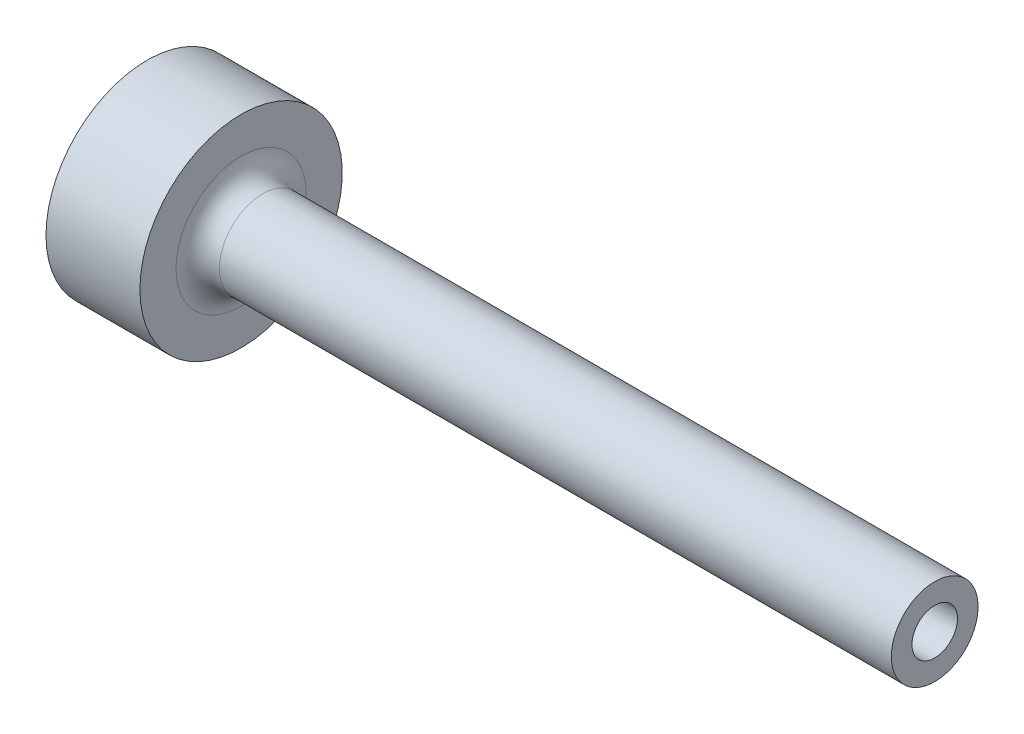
ISO-10303-21;
HEADER;
FILE_DESCRIPTION(('STEP AP214'),'2;1');
FILE_NAME('part.step','',(''),(''),'','','');
FILE_SCHEMA(('AUTOMOTIVE_DESIGN { 1 0 10303 214 1 1 1 1 }'));
ENDSEC;
DATA;
#1=APPLICATION_CONTEXT('core data for automotive mechanical design processes');
#2=APPLICATION_PROTOCOL_DEFINITION('international standard','automotive_design',2000,#1);
#3=PRODUCT_CONTEXT('',#1,'mechanical');
#4=PRODUCT('Part','Part','',(#3));
#5=PRODUCT_RELATED_PRODUCT_CATEGORY('part','',(#4));
#6=PRODUCT_DEFINITION_FORMATION('','',#4);
#7=PRODUCT_DEFINITION_CONTEXT('part definition',#1,'design');
#8=PRODUCT_DEFINITION('design','',#6,#7);
#9=PRODUCT_DEFINITION_SHAPE('','',#8);
#10=(LENGTH_UNIT() NAMED_UNIT(*) SI_UNIT(.MILLI.,.METRE.));
#11=(NAMED_UNIT(*) PLANE_ANGLE_UNIT() SI_UNIT($,.RADIAN.));
#12=(NAMED_UNIT(*) SI_UNIT($,.STERADIAN.) SOLID_ANGLE_UNIT());
#13=UNCERTAINTY_MEASURE_WITH_UNIT(LENGTH_MEASURE(1.E-05),#10,'distance_accuracy_value','');
#14=(GEOMETRIC_REPRESENTATION_CONTEXT(3) GLOBAL_UNCERTAINTY_ASSIGNED_CONTEXT((#13)) GLOBAL_UNIT_ASSIGNED_CONTEXT((#10,
#11,#12)) REPRESENTATION_CONTEXT('',''));
#15=CARTESIAN_POINT('',(0.,0.,0.));
#16=DIRECTION('',(0.,0.,1.));
#17=DIRECTION('',(1.,0.,0.));
#18=AXIS2_PLACEMENT_3D('',#15,#16,#17);
#19=CARTESIAN_POINT('',(0.,0.,0.));
#20=DIRECTION('',(-1.,0.,0.));
#21=DIRECTION('',(0.,0.,1.));
#22=AXIS2_PLACEMENT_3D('',#19,#20,#21);
#23=CYLINDRICAL_SURFACE('',#22,14.);
#24=CARTESIAN_POINT('',(13.,0.,0.));
#25=DIRECTION('',(-1.,0.,0.));
#26=DIRECTION('',(0.,0.,1.));
#27=AXIS2_PLACEMENT_3D('',#24,#25,#26);
#28=CIRCLE('',#27,14.);
#29=CARTESIAN_POINT('',(13.,0.,14.));
#30=VERTEX_POINT('',#29);
#31=EDGE_CURVE('E89',#30,#30,#28,.T.);
#32=ORIENTED_EDGE('',*,*,#31,.T.);
#33=EDGE_LOOP('',(#32));
#34=FACE_BOUND('',#33,.T.);
#35=CARTESIAN_POINT('',(0.,0.,0.));
#36=DIRECTION('',(-1.,0.,0.));
#37=DIRECTION('',(0.,0.,1.));
#38=AXIS2_PLACEMENT_3D('',#35,#36,#37);
#39=CIRCLE('',#38,14.);
#40=CARTESIAN_POINT('',(0.,0.,14.));
#41=VERTEX_POINT('',#40);
#42=EDGE_CURVE('E84',#41,#41,#39,.T.);
#43=ORIENTED_EDGE('',*,*,#42,.F.);
#44=EDGE_LOOP('',(#43));
#45=FACE_BOUND('',#44,.T.);
#46=CARTESIAN_POINT('',(6.5,-13.856406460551,-2.));
#47=CARTESIAN_POINT('',(6.61172417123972,-13.8564082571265,-1.99999534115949));
#48=CARTESIAN_POINT('',(6.72351471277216,-13.8577723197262,-1.99060664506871));
#49=CARTESIAN_POINT('',(6.9439746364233,-13.8630779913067,-1.95330740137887));
#50=CARTESIAN_POINT('',(7.05264079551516,-13.8670221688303,-1.92537839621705));
#51=CARTESIAN_POINT('',(7.26362870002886,-13.8770324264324,-1.85184738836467));
#52=CARTESIAN_POINT('',(7.36595507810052,-13.8830969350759,-1.80625847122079));
#53=CARTESIAN_POINT('',(7.56148972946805,-13.8966626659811,-1.69873175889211));
#54=CARTESIAN_POINT('',(7.65469934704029,-13.9041636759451,-1.63679637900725));
#55=CARTESIAN_POINT('',(7.83004829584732,-13.9198182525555,-1.49785346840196));
#56=CARTESIAN_POINT('',(7.91211171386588,-13.9279757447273,-1.42075056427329));
#57=CARTESIAN_POINT('',(8.06218155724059,-13.9439890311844,-1.25386707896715));
#58=CARTESIAN_POINT('',(8.13018723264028,-13.9518448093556,-1.16408582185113));
#59=CARTESIAN_POINT('',(8.25048909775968,-13.9664103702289,-0.973910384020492));
#60=CARTESIAN_POINT('',(8.30271571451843,-13.9731150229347,-0.873471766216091));
#61=CARTESIAN_POINT('',(8.38953073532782,-13.9845795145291,-0.665136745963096));
#62=CARTESIAN_POINT('',(8.4241199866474,-13.9893394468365,-0.557240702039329));
#63=CARTESIAN_POINT('',(8.47444920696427,-13.9963505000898,-0.337834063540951));
#64=CARTESIAN_POINT('',(8.49031606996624,-13.9986185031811,-0.226353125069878));
#65=CARTESIAN_POINT('',(8.5031438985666,-14.0004479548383,-0.00228956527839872));
#66=CARTESIAN_POINT('',(8.50010582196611,-14.0000095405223,0.110292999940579));
#67=CARTESIAN_POINT('',(8.47531062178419,-13.9964890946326,0.33249899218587));
#68=CARTESIAN_POINT('',(8.45369000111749,-13.9934263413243,0.442137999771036));
#69=CARTESIAN_POINT('',(8.39255744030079,-13.9850228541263,0.656215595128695));
#70=CARTESIAN_POINT('',(8.3530450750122,-13.9796820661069,0.760654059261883));
#71=CARTESIAN_POINT('',(8.25710925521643,-13.9672894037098,0.961781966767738));
#72=CARTESIAN_POINT('',(8.20062784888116,-13.9602316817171,1.05844339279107));
#73=CARTESIAN_POINT('',(8.07239950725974,-13.9451926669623,1.24096782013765));
#74=CARTESIAN_POINT('',(8.00065165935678,-13.9372113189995,1.32683017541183));
#75=CARTESIAN_POINT('',(7.843165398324,-13.921132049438,1.48612299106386));
#76=CARTESIAN_POINT('',(7.75730786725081,-13.9130337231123,1.55943569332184));
#77=CARTESIAN_POINT('',(7.57444547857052,-13.8977029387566,1.69062989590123));
#78=CARTESIAN_POINT('',(7.47744056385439,-13.890470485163,1.74851131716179));
#79=CARTESIAN_POINT('',(7.27491971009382,-13.8776905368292,1.84721301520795));
#80=CARTESIAN_POINT('',(7.1693981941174,-13.8721441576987,1.88802200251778));
#81=CARTESIAN_POINT('',(6.95290242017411,-13.8633846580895,1.9513062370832));
#82=CARTESIAN_POINT('',(6.84192850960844,-13.8601713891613,1.97378265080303));
#83=CARTESIAN_POINT('',(6.61872346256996,-13.8564698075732,1.99960390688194));
#84=CARTESIAN_POINT('',(6.50651197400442,-13.8559577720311,2.00311531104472));
#85=CARTESIAN_POINT('',(6.28310219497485,-13.8576537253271,1.9913480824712));
#86=CARTESIAN_POINT('',(6.17190387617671,-13.8598616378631,1.9760699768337));
#87=CARTESIAN_POINT('',(5.95418781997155,-13.8667269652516,1.92729837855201));
#88=CARTESIAN_POINT('',(5.84765127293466,-13.8713733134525,1.8938871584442));
#89=CARTESIAN_POINT('',(5.6416912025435,-13.8825829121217,1.80988306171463));
#90=CARTESIAN_POINT('',(5.54226800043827,-13.8891462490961,1.75928940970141));
#91=CARTESIAN_POINT('',(5.35260812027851,-13.9035064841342,1.64195360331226));
#92=CARTESIAN_POINT('',(5.26243903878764,-13.911311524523,1.57510320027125));
#93=CARTESIAN_POINT('',(5.09454027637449,-13.9272509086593,1.42730277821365));
#94=CARTESIAN_POINT('',(5.01681123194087,-13.9353852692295,1.34635203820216));
#95=CARTESIAN_POINT('',(4.8754047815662,-13.9511405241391,1.17191708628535));
#96=CARTESIAN_POINT('',(4.81183747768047,-13.9587570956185,1.07834317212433));
#97=CARTESIAN_POINT('',(4.70132443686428,-13.972552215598,0.881748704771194));
#98=CARTESIAN_POINT('',(4.65437828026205,-13.9787308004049,0.778728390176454));
#99=CARTESIAN_POINT('',(4.57861788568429,-13.9889347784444,0.566515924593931));
#100=CARTESIAN_POINT('',(4.54974241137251,-13.9929674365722,0.457345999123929));
#101=CARTESIAN_POINT('',(4.51074453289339,-13.9984555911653,0.235645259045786));
#102=CARTESIAN_POINT('',(4.50062101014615,-13.9999112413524,0.123114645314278));
#103=CARTESIAN_POINT('',(4.49943976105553,-14.0000800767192,-0.101043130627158));
#104=CARTESIAN_POINT('',(4.50821318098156,-13.998817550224,-0.212669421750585));
#105=CARTESIAN_POINT('',(4.54421615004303,-13.9937406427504,-0.432842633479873));
#106=CARTESIAN_POINT('',(4.57144565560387,-13.989926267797,-0.541389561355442));
#107=CARTESIAN_POINT('',(4.6435299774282,-13.9801722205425,-0.752283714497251));
#108=CARTESIAN_POINT('',(4.68837418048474,-13.9742338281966,-0.854634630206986));
#109=CARTESIAN_POINT('',(4.79439714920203,-13.960885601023,-1.05038570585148));
#110=CARTESIAN_POINT('',(4.8555763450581,-13.9534757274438,-1.14378562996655));
#111=CARTESIAN_POINT('',(4.99314771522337,-13.9379304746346,-1.31984194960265));
#112=CARTESIAN_POINT('',(5.06966490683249,-13.9297894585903,-1.40240016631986));
#113=CARTESIAN_POINT('',(5.2354775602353,-13.9137422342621,-1.55356716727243));
#114=CARTESIAN_POINT('',(5.32477602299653,-13.9058360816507,-1.6221726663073));
#115=CARTESIAN_POINT('',(5.51414543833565,-13.8911108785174,-1.74379523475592));
#116=CARTESIAN_POINT('',(5.61426869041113,-13.8842975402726,-1.79673154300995));
#117=CARTESIAN_POINT('',(5.82203229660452,-13.8725962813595,-1.88495902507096));
#118=CARTESIAN_POINT('',(5.92966459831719,-13.8677063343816,-1.92026877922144));
#119=CARTESIAN_POINT('',(6.11483642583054,-13.8615529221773,-1.96409255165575));
#120=CARTESIAN_POINT('',(6.19122433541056,-13.859633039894,-1.97753762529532));
#121=CARTESIAN_POINT('',(6.34506419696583,-13.857059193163,-1.99549291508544));
#122=CARTESIAN_POINT('',(6.42251613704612,-13.8564052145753,-2.00000323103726));
#123=CARTESIAN_POINT('',(6.5,-13.856406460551,-2.));
#124=B_SPLINE_CURVE_WITH_KNOTS('',3,(#46,#47,#48,#49,#50,#51,#52,#53,#54,#55,#56,#57,#58,#59,
#60,#61,#62,#63,#64,#65,#66,#67,#68,#69,#70,#71,#72,#73,#74,#75,#76,#77,#78,#79,#80,#81,#82,#83,
#84,#85,#86,#87,#88,#89,#90,#91,#92,#93,#94,#95,#96,#97,#98,#99,#100,#101,#102,#103,#104,#105,
#106,#107,#108,#109,#110,#111,#112,#113,#114,#115,#116,#117,#118,#119,#120,#121,#122,#123),
.UNSPECIFIED.,.T.,.F.,(4,2,2,2,2,2,2,2,2,2,2,2,2,2,2,2,2,2,2,2,2,2,2,2,2,2,2,2,2,2,2,2,2,2,2,2,
2,2,4),(0.,0.334889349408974,0.670112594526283,1.00508792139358,1.34001378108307,
1.6771171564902,2.01423851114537,2.35282530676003,2.6913958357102,3.02765822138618,
3.36390357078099,3.69769984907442,4.03150405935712,4.36646147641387,4.70143892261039,
5.03940517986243,5.37737316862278,5.7155642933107,6.05373389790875,6.3889286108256,
6.72411392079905,7.05779100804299,7.39148315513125,7.72746121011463,8.06345644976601,
8.40197921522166,8.74049343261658,9.07785422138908,9.41519488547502,9.74953375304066,
10.083871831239,10.4180087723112,10.7521545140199,11.0891434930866,11.426211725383,
11.7649881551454,12.103406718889,12.3356645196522,12.5679197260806),.UNSPECIFIED.);
#125=CARTESIAN_POINT('',(6.5,-13.856406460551,-2.));
#126=VERTEX_POINT('',#125);
#127=EDGE_CURVE('E10',#126,#126,#124,.T.);
#128=ORIENTED_EDGE('',*,*,#127,.F.);
#129=EDGE_LOOP('',(#128));
#130=FACE_BOUND('',#129,.T.);
#131=ADVANCED_FACE('F16',(#34,#45,#130),#23,.T.);
#132=CARTESIAN_POINT('',(0.,0.,0.));
#133=DIRECTION('',(1.,0.,0.));
#134=DIRECTION('',(0.,0.,-1.));
#135=AXIS2_PLACEMENT_3D('',#132,#133,#134);
#136=CONICAL_SURFACE('',#135,1.25,0.0174532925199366);
#137=CARTESIAN_POINT('',(109.,0.,0.));
#138=DIRECTION('',(-1.,0.,0.));
#139=DIRECTION('',(0.,0.,1.));
#140=AXIS2_PLACEMENT_3D('',#137,#138,#139);
#141=CIRCLE('',#140,3.15260207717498);
#142=CARTESIAN_POINT('',(109.,0.,3.15260207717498));
#143=VERTEX_POINT('',#142);
#144=EDGE_CURVE('E81',#143,#143,#141,.T.);
#145=ORIENTED_EDGE('',*,*,#144,.F.);
#146=EDGE_LOOP('',(#145));
#147=FACE_BOUND('',#146,.T.);
#148=CARTESIAN_POINT('',(1.22738614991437,0.,0.));
#149=DIRECTION('',(-1.,0.,0.));
#150=DIRECTION('',(0.,0.,1.));
#151=AXIS2_PLACEMENT_3D('',#148,#149,#150);
#152=CIRCLE('',#151,1.27142410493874);
#153=CARTESIAN_POINT('',(1.22738614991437,0.,1.27142410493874));
#154=VERTEX_POINT('',#153);
#155=EDGE_CURVE('E94',#154,#154,#152,.F.);
#156=ORIENTED_EDGE('',*,*,#155,.F.);
#157=EDGE_LOOP('',(#156));
#158=FACE_BOUND('',#157,.T.);
#159=ADVANCED_FACE('F45',(#147,#158),#136,.F.);
#160=CARTESIAN_POINT('',(16.,0.,0.));
#161=DIRECTION('',(-1.,0.,0.));
#162=DIRECTION('',(0.,0.,1.));
#163=AXIS2_PLACEMENT_3D('',#160,#161,#162);
#164=TOROIDAL_SURFACE('',#163,9.,3.);
#165=CARTESIAN_POINT('',(13.,0.,0.));
#166=DIRECTION('',(-1.,0.,0.));
#167=DIRECTION('',(0.,0.,1.));
#168=AXIS2_PLACEMENT_3D('',#165,#166,#167);
#169=CIRCLE('',#168,9.);
#170=CARTESIAN_POINT('',(13.,0.,9.));
#171=VERTEX_POINT('',#170);
#172=EDGE_CURVE('E91',#171,#171,#169,.T.);
#173=ORIENTED_EDGE('',*,*,#172,.F.);
#174=EDGE_LOOP('',(#173));
#175=FACE_BOUND('',#174,.T.);
#176=CARTESIAN_POINT('',(16.,0.,0.));
#177=DIRECTION('',(-1.,0.,0.));
#178=DIRECTION('',(0.,0.,1.));
#179=AXIS2_PLACEMENT_3D('',#176,#177,#178);
#180=CIRCLE('',#179,6.);
#181=CARTESIAN_POINT('',(16.,0.,6.));
#182=VERTEX_POINT('',#181);
#183=EDGE_CURVE('E28',#182,#182,#180,.T.);
#184=ORIENTED_EDGE('',*,*,#183,.T.);
#185=EDGE_LOOP('',(#184));
#186=FACE_BOUND('',#185,.T.);
#187=ADVANCED_FACE('F18',(#175,#186),#164,.F.);
#188=CARTESIAN_POINT('',(0.,0.,0.));
#189=DIRECTION('',(-1.,0.,0.));
#190=DIRECTION('',(0.,0.,1.));
#191=AXIS2_PLACEMENT_3D('',#188,#189,#190);
#192=CYLINDRICAL_SURFACE('',#191,6.);
#193=ORIENTED_EDGE('',*,*,#183,.F.);
#194=EDGE_LOOP('',(#193));
#195=FACE_BOUND('',#194,.T.);
#196=CARTESIAN_POINT('',(109.,0.,0.));
#197=DIRECTION('',(-1.,0.,0.));
#198=DIRECTION('',(0.,0.,1.));
#199=AXIS2_PLACEMENT_3D('',#196,#197,#198);
#200=CIRCLE('',#199,6.);
#201=CARTESIAN_POINT('',(109.,0.,6.));
#202=VERTEX_POINT('',#201);
#203=EDGE_CURVE('E80',#202,#202,#200,.T.);
#204=ORIENTED_EDGE('',*,*,#203,.T.);
#205=EDGE_LOOP('',(#204));
#206=FACE_BOUND('',#205,.T.);
#207=ADVANCED_FACE('F66',(#195,#206),#192,.T.);
#208=CARTESIAN_POINT('',(109.,6.,0.));
#209=DIRECTION('',(-1.,0.,0.));
#210=DIRECTION('',(0.,0.,1.));
#211=AXIS2_PLACEMENT_3D('',#208,#209,#210);
#212=PLANE('',#211);
#213=ORIENTED_EDGE('',*,*,#203,.F.);
#214=EDGE_LOOP('',(#213));
#215=FACE_BOUND('',#214,.T.);
#216=ORIENTED_EDGE('',*,*,#144,.T.);
#217=EDGE_LOOP('',(#216));
#218=FACE_BOUND('',#217,.T.);
#219=ADVANCED_FACE('F62',(#215,#218),#212,.F.);
#220=CARTESIAN_POINT('',(0.,1.25,0.));
#221=DIRECTION('',(1.,0.,0.));
#222=DIRECTION('',(0.,0.,-1.));
#223=AXIS2_PLACEMENT_3D('',#220,#221,#222);
#224=PLANE('',#223);
#225=CARTESIAN_POINT('',(0.,0.,0.));
#226=DIRECTION('',(-1.,0.,0.));
#227=DIRECTION('',(0.,0.,1.));
#228=AXIS2_PLACEMENT_3D('',#225,#226,#227);
#229=CIRCLE('',#228,5.);
#230=CARTESIAN_POINT('',(0.,0.,5.));
#231=VERTEX_POINT('',#230);
#232=EDGE_CURVE('E97',#231,#231,#229,.T.);
#233=ORIENTED_EDGE('',*,*,#232,.F.);
#234=EDGE_LOOP('',(#233));
#235=FACE_BOUND('',#234,.T.);
#236=ORIENTED_EDGE('',*,*,#42,.T.);
#237=EDGE_LOOP('',(#236));
#238=FACE_BOUND('',#237,.T.);
#239=ADVANCED_FACE('F60',(#235,#238),#224,.F.);
#240=CARTESIAN_POINT('',(13.,14.,0.));
#241=DIRECTION('',(-1.,0.,0.));
#242=DIRECTION('',(0.,0.,1.));
#243=AXIS2_PLACEMENT_3D('',#240,#241,#242);
#244=PLANE('',#243);
#245=ORIENTED_EDGE('',*,*,#31,.F.);
#246=EDGE_LOOP('',(#245));
#247=FACE_BOUND('',#246,.T.);
#248=ORIENTED_EDGE('',*,*,#172,.T.);
#249=EDGE_LOOP('',(#248));
#250=FACE_BOUND('',#249,.T.);
#251=ADVANCED_FACE('F58',(#247,#250),#244,.F.);
#252=CARTESIAN_POINT('',(-37.3349076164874,0.,0.));
#253=DIRECTION('',(-1.,0.,0.));
#254=DIRECTION('',(0.,0.,1.));
#255=AXIS2_PLACEMENT_3D('',#252,#253,#254);
#256=DEGENERATE_TOROIDAL_SURFACE('',#255,9.35634609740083,40.,.F.);
#257=ORIENTED_EDGE('',*,*,#232,.T.);
#258=EDGE_LOOP('',(#257));
#259=FACE_BOUND('',#258,.T.);
#260=ORIENTED_EDGE('',*,*,#155,.T.);
#261=EDGE_LOOP('',(#260));
#262=FACE_BOUND('',#261,.T.);
#263=ADVANCED_FACE('F41',(#259,#262),#256,.T.);
#264=CARTESIAN_POINT('',(6.5,-14.,0.));
#265=DIRECTION('',(0.,-1.,0.));
#266=DIRECTION('',(0.,0.,-1.));
#267=AXIS2_PLACEMENT_3D('',#264,#265,#266);
#268=CYLINDRICAL_SURFACE('',#267,2.);
#269=CARTESIAN_POINT('',(6.5,-8.,0.));
#270=DIRECTION('',(0.,-1.,0.));
#271=DIRECTION('',(0.,0.,-1.));
#272=AXIS2_PLACEMENT_3D('',#269,#270,#271);
#273=CIRCLE('',#272,2.);
#274=CARTESIAN_POINT('',(6.5,-8.,-2.));
#275=VERTEX_POINT('',#274);
#276=EDGE_CURVE('E100',#275,#275,#273,.T.);
#277=ORIENTED_EDGE('',*,*,#276,.F.);
#278=EDGE_LOOP('',(#277));
#279=FACE_BOUND('',#278,.T.);
#280=ORIENTED_EDGE('',*,*,#127,.T.);
#281=EDGE_LOOP('',(#280));
#282=FACE_BOUND('',#281,.T.);
#283=ADVANCED_FACE('F33',(#279,#282),#268,.F.);
#284=CARTESIAN_POINT('',(6.5,-6.84529946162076,0.));
#285=DIRECTION('',(0.,-1.,0.));
#286=DIRECTION('',(0.,0.,-1.));
#287=AXIS2_PLACEMENT_3D('',#284,#285,#286);
#288=CONICAL_SURFACE('',#287,0.,1.0471975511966);
#289=ORIENTED_EDGE('',*,*,#276,.T.);
#290=EDGE_LOOP('',(#289));
#291=FACE_BOUND('',#290,.T.);
#292=CARTESIAN_POINT('',(6.5,-6.84529946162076,0.));
#293=VERTEX_POINT('',#292);
#294=VERTEX_LOOP('',#293);
#295=FACE_BOUND('',#294,.T.);
#296=ADVANCED_FACE('F31',(#291,#295),#288,.F.);
#297=CLOSED_SHELL('',(#131,#159,#187,#207,#219,#239,#251,#263,#283,#296));
#298=MANIFOLD_SOLID_BREP('B1',#297);
#299=ADVANCED_BREP_SHAPE_REPRESENTATION('',(#18,#298),#14);
#300=SHAPE_DEFINITION_REPRESENTATION(#9,#299);
ENDSEC;
END-ISO-10303-21;
